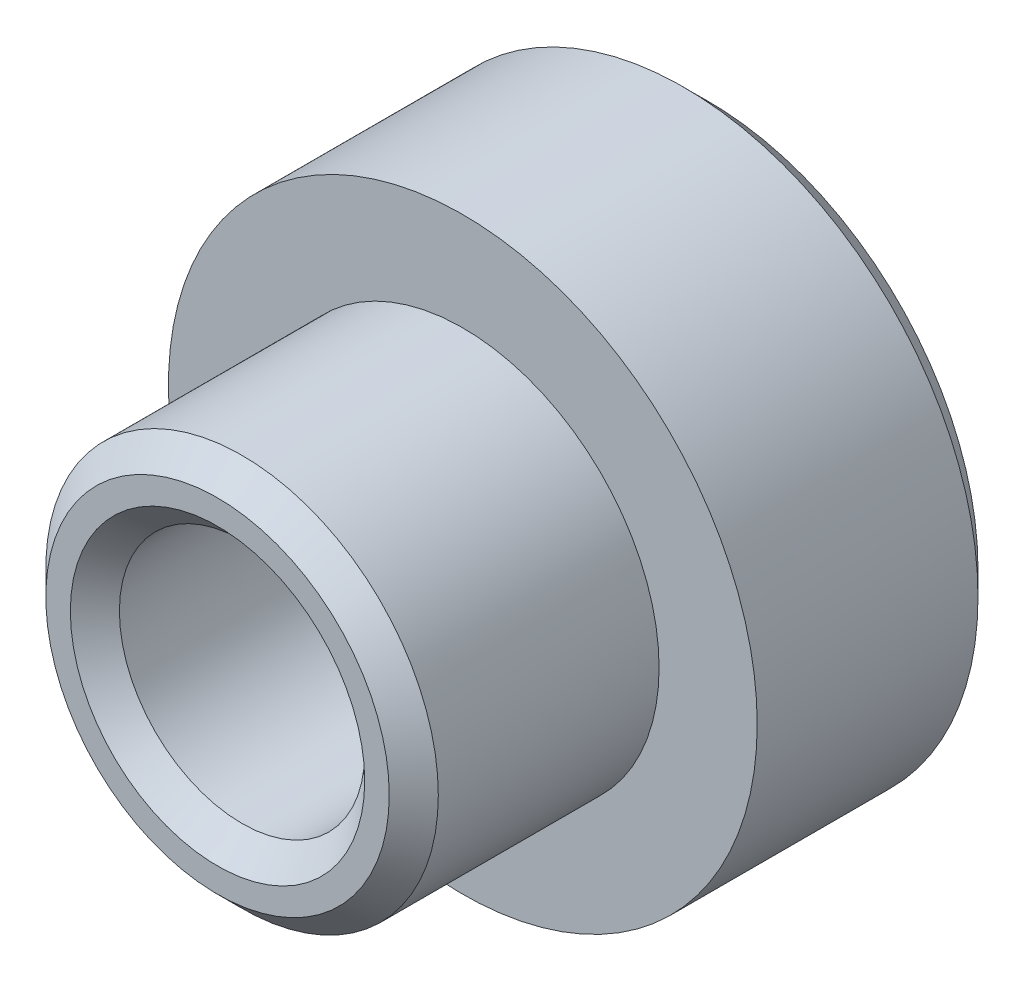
from build123d import *

# Parameters (mm, degrees)
ESQUISSE1_R          = 6
ESQUISSE1_R_2        = 2.5
BASE_EXTRUSION_DEPTH = 5
ESQUISSE2_R          = 4
ESQUISSE2_R_2        = 2.5
BOSS_EXTRU_1_DEPTH   = 5
CHANFREIN1_SIZE      = 0.5


with BuildPart() as part:
    # Esquisse1 → Base-Extrusion (new body)
    with BuildSketch(Plane.XY):
        Circle(ESQUISSE1_R)
        Circle(ESQUISSE1_R_2, mode=Mode.SUBTRACT)
    extrude(amount=BASE_EXTRUSION_DEPTH)

    # Esquisse2 → Boss.-Extru.1 (add)
    with BuildSketch(Plane.XY.offset(5)):
        Circle(ESQUISSE2_R)
        Circle(ESQUISSE2_R_2, mode=Mode.SUBTRACT)
    extrude(amount=BOSS_EXTRU_1_DEPTH)

    # Chanfrein1
    chanfrein1_edges = [part.edges().sort_by_distance(p)[0] for p in [
        (-6, 0, 0),
        (-4, 0, 10),
        (-2.5, 0, 10),
        (-2.5, 0, 0),
    ]]
    chamfer(chanfrein1_edges, length=CHANFREIN1_SIZE)


solid = part.part
